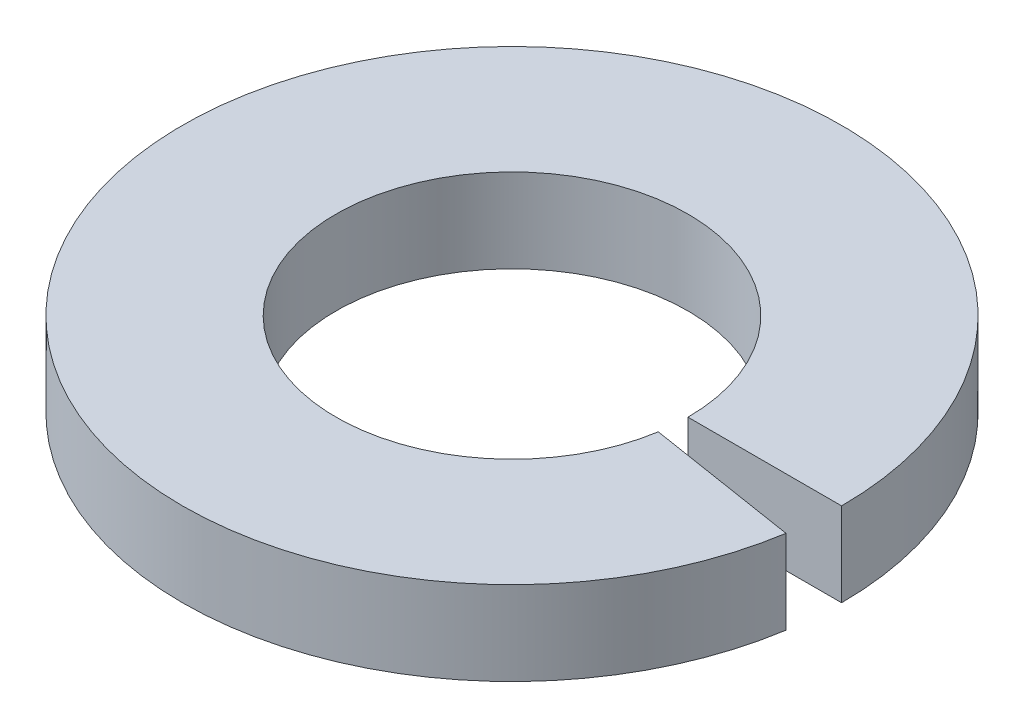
from build123d import *

# Parameters (mm, degrees)
SKETCH1_W          = 2.8829
SKETCH1_H          = 1.5748
BASE_REVOLVE_ANGLE = 351


with BuildPart() as part:
    # Sketch1 → Base-Revolve (revolve)
    with BuildSketch(Plane.XY):
        with Locations((4.74345, 0.7874)):
            Rectangle(SKETCH1_W, SKETCH1_H)
    revolve(axis=Axis((0, -78.74, 0), (0, 1, 0)), revolution_arc=BASE_REVOLVE_ANGLE)


solid = part.part
